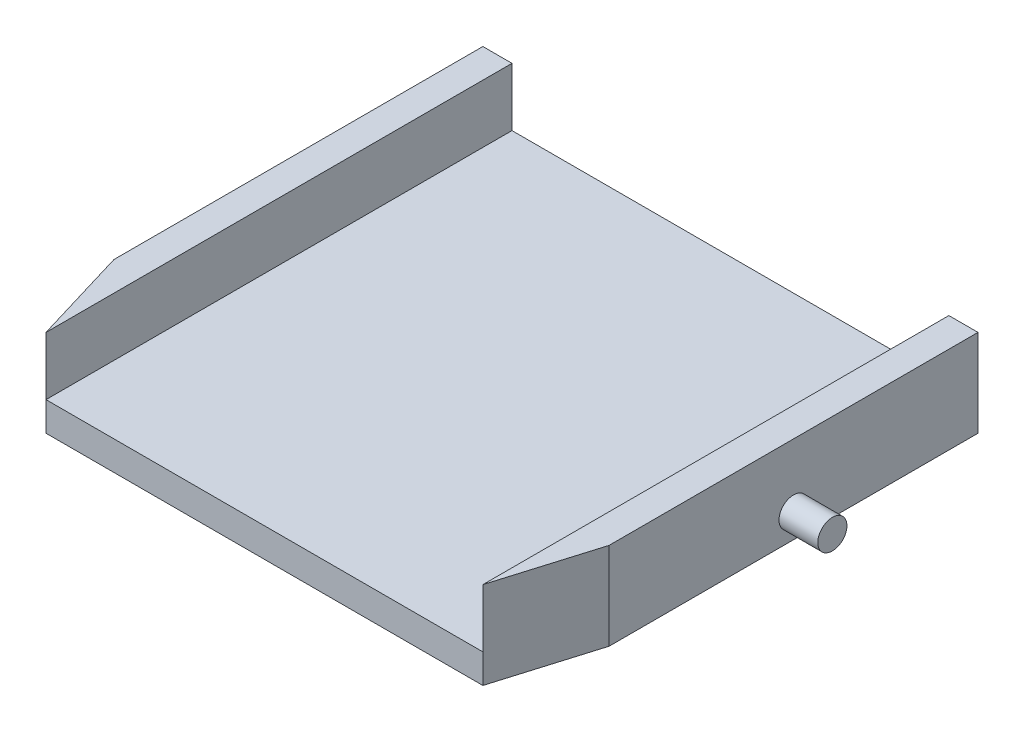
ISO-10303-21;
HEADER;
FILE_DESCRIPTION(('STEP AP214'),'2;1');
FILE_NAME('part.step','',(''),(''),'','','');
FILE_SCHEMA(('AUTOMOTIVE_DESIGN { 1 0 10303 214 1 1 1 1 }'));
ENDSEC;
DATA;
#1=APPLICATION_CONTEXT('core data for automotive mechanical design processes');
#2=APPLICATION_PROTOCOL_DEFINITION('international standard','automotive_design',2000,#1);
#3=PRODUCT_CONTEXT('',#1,'mechanical');
#4=PRODUCT('Part','Part','',(#3));
#5=PRODUCT_RELATED_PRODUCT_CATEGORY('part','',(#4));
#6=PRODUCT_DEFINITION_FORMATION('','',#4);
#7=PRODUCT_DEFINITION_CONTEXT('part definition',#1,'design');
#8=PRODUCT_DEFINITION('design','',#6,#7);
#9=PRODUCT_DEFINITION_SHAPE('','',#8);
#10=(LENGTH_UNIT() NAMED_UNIT(*) SI_UNIT(.MILLI.,.METRE.));
#11=(NAMED_UNIT(*) PLANE_ANGLE_UNIT() SI_UNIT($,.RADIAN.));
#12=(NAMED_UNIT(*) SI_UNIT($,.STERADIAN.) SOLID_ANGLE_UNIT());
#13=UNCERTAINTY_MEASURE_WITH_UNIT(LENGTH_MEASURE(1.E-05),#10,'distance_accuracy_value','');
#14=(GEOMETRIC_REPRESENTATION_CONTEXT(3) GLOBAL_UNCERTAINTY_ASSIGNED_CONTEXT((#13)) GLOBAL_UNIT_ASSIGNED_CONTEXT((#10,
#11,#12)) REPRESENTATION_CONTEXT('',''));
#15=CARTESIAN_POINT('',(0.,0.,0.));
#16=DIRECTION('',(0.,0.,1.));
#17=DIRECTION('',(1.,0.,0.));
#18=AXIS2_PLACEMENT_3D('',#15,#16,#17);
#19=CARTESIAN_POINT('',(0.,3.,0.));
#20=DIRECTION('',(0.,-1.,0.));
#21=DIRECTION('',(0.,0.,-1.));
#22=AXIS2_PLACEMENT_3D('',#19,#20,#21);
#23=PLANE('',#22);
#24=DIRECTION('',(0.,0.,1.));
#25=VECTOR('',#24,1.);
#26=CARTESIAN_POINT('',(45.,3.,-48.));
#27=LINE('',#26,#25);
#28=CARTESIAN_POINT('',(45.,3.,-48.));
#29=VERTEX_POINT('',#28);
#30=CARTESIAN_POINT('',(45.,3.,0.));
#31=VERTEX_POINT('',#30);
#32=EDGE_CURVE('E165',#29,#31,#27,.T.);
#33=ORIENTED_EDGE('',*,*,#32,.F.);
#34=DIRECTION('',(-1.,0.,0.));
#35=VECTOR('',#34,1.);
#36=CARTESIAN_POINT('',(48.,3.,-48.));
#37=LINE('',#36,#35);
#38=CARTESIAN_POINT('',(0.,3.,-48.));
#39=VERTEX_POINT('',#38);
#40=EDGE_CURVE('E96',#29,#39,#37,.T.);
#41=ORIENTED_EDGE('',*,*,#40,.T.);
#42=DIRECTION('',(0.,0.,-1.));
#43=VECTOR('',#42,1.);
#44=CARTESIAN_POINT('',(0.,3.,0.));
#45=LINE('',#44,#43);
#46=CARTESIAN_POINT('',(0.,3.,0.));
#47=VERTEX_POINT('',#46);
#48=EDGE_CURVE('E172',#47,#39,#45,.T.);
#49=ORIENTED_EDGE('',*,*,#48,.F.);
#50=DIRECTION('',(1.,0.,0.));
#51=VECTOR('',#50,1.);
#52=CARTESIAN_POINT('',(0.,3.,0.));
#53=LINE('',#52,#51);
#54=EDGE_CURVE('E50',#47,#31,#53,.T.);
#55=ORIENTED_EDGE('',*,*,#54,.T.);
#56=EDGE_LOOP('',(#33,#41,#49,#55));
#57=FACE_BOUND('',#56,.T.);
#58=ADVANCED_FACE('F33',(#57),#23,.F.);
#59=CARTESIAN_POINT('',(0.,3.,0.));
#60=DIRECTION('',(0.957826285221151,0.,-0.287347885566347));
#61=DIRECTION('',(-0.287347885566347,0.,-0.957826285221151));
#62=AXIS2_PLACEMENT_3D('',#59,#60,#61);
#63=PLANE('',#62);
#64=DIRECTION('',(0.287347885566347,0.,0.957826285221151));
#65=VECTOR('',#64,1.);
#66=CARTESIAN_POINT('',(0.,0.,0.));
#67=LINE('',#66,#65);
#68=CARTESIAN_POINT('',(-3.00000000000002,0.,-10.));
#69=VERTEX_POINT('',#68);
#70=CARTESIAN_POINT('',(0.,0.,0.));
#71=VERTEX_POINT('',#70);
#72=EDGE_CURVE('E92',#69,#71,#67,.T.);
#73=ORIENTED_EDGE('',*,*,#72,.T.);
#74=DIRECTION('',(0.,-1.,0.));
#75=VECTOR('',#74,1.);
#76=CARTESIAN_POINT('',(0.,3.,0.));
#77=LINE('',#76,#75);
#78=EDGE_CURVE('E126',#47,#71,#77,.T.);
#79=ORIENTED_EDGE('',*,*,#78,.F.);
#80=DIRECTION('',(0.,-1.,0.));
#81=VECTOR('',#80,1.);
#82=CARTESIAN_POINT('',(0.,9.,0.));
#83=LINE('',#82,#81);
#84=CARTESIAN_POINT('',(0.,9.,0.));
#85=VERTEX_POINT('',#84);
#86=EDGE_CURVE('E102',#85,#47,#83,.T.);
#87=ORIENTED_EDGE('',*,*,#86,.F.);
#88=DIRECTION('',(0.287347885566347,0.,0.957826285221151));
#89=VECTOR('',#88,1.);
#90=CARTESIAN_POINT('',(-3.00000000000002,9.,-10.));
#91=LINE('',#90,#89);
#92=CARTESIAN_POINT('',(-3.00000000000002,9.,-10.));
#93=VERTEX_POINT('',#92);
#94=EDGE_CURVE('E95',#93,#85,#91,.T.);
#95=ORIENTED_EDGE('',*,*,#94,.F.);
#96=DIRECTION('',(0.,-1.,0.));
#97=VECTOR('',#96,1.);
#98=CARTESIAN_POINT('',(-3.00000000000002,3.,-10.));
#99=LINE('',#98,#97);
#100=EDGE_CURVE('E82',#93,#69,#99,.T.);
#101=ORIENTED_EDGE('',*,*,#100,.T.);
#102=EDGE_LOOP('',(#73,#79,#87,#95,#101));
#103=FACE_BOUND('',#102,.T.);
#104=ADVANCED_FACE('F35',(#103),#63,.F.);
#105=CARTESIAN_POINT('',(0.,3.,0.));
#106=DIRECTION('',(0.,0.,-1.));
#107=DIRECTION('',(-1.,0.,0.));
#108=AXIS2_PLACEMENT_3D('',#105,#106,#107);
#109=PLANE('',#108);
#110=DIRECTION('',(1.,0.,0.));
#111=VECTOR('',#110,1.);
#112=CARTESIAN_POINT('',(0.,0.,0.));
#113=LINE('',#112,#111);
#114=CARTESIAN_POINT('',(45.,0.,0.));
#115=VERTEX_POINT('',#114);
#116=EDGE_CURVE('E100',#71,#115,#113,.T.);
#117=ORIENTED_EDGE('',*,*,#116,.T.);
#118=DIRECTION('',(0.,-1.,0.));
#119=VECTOR('',#118,1.);
#120=CARTESIAN_POINT('',(45.,3.,0.));
#121=LINE('',#120,#119);
#122=EDGE_CURVE('E123',#31,#115,#121,.T.);
#123=ORIENTED_EDGE('',*,*,#122,.F.);
#124=ORIENTED_EDGE('',*,*,#54,.F.);
#125=ORIENTED_EDGE('',*,*,#78,.T.);
#126=EDGE_LOOP('',(#117,#123,#124,#125));
#127=FACE_BOUND('',#126,.T.);
#128=ADVANCED_FACE('F228',(#127),#109,.F.);
#129=CARTESIAN_POINT('',(45.,3.,0.));
#130=DIRECTION('',(-0.957826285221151,0.,-0.287347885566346));
#131=DIRECTION('',(-0.287347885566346,0.,0.957826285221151));
#132=AXIS2_PLACEMENT_3D('',#129,#130,#131);
#133=PLANE('',#132);
#134=DIRECTION('',(0.287347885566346,0.,-0.957826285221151));
#135=VECTOR('',#134,1.);
#136=CARTESIAN_POINT('',(45.,0.,0.));
#137=LINE('',#136,#135);
#138=CARTESIAN_POINT('',(48.,0.,-10.));
#139=VERTEX_POINT('',#138);
#140=EDGE_CURVE('E104',#115,#139,#137,.T.);
#141=ORIENTED_EDGE('',*,*,#140,.T.);
#142=DIRECTION('',(0.,-1.,0.));
#143=VECTOR('',#142,1.);
#144=CARTESIAN_POINT('',(48.,3.,-10.));
#145=LINE('',#144,#143);
#146=CARTESIAN_POINT('',(48.,9.,-10.));
#147=VERTEX_POINT('',#146);
#148=EDGE_CURVE('E120',#147,#139,#145,.T.);
#149=ORIENTED_EDGE('',*,*,#148,.F.);
#150=DIRECTION('',(0.287347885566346,0.,-0.957826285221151));
#151=VECTOR('',#150,1.);
#152=CARTESIAN_POINT('',(45.,9.,0.));
#153=LINE('',#152,#151);
#154=CARTESIAN_POINT('',(45.,9.,0.));
#155=VERTEX_POINT('',#154);
#156=EDGE_CURVE('E161',#155,#147,#153,.T.);
#157=ORIENTED_EDGE('',*,*,#156,.F.);
#158=DIRECTION('',(0.,-1.,0.));
#159=VECTOR('',#158,1.);
#160=CARTESIAN_POINT('',(45.,9.,0.));
#161=LINE('',#160,#159);
#162=EDGE_CURVE('E159',#155,#31,#161,.T.);
#163=ORIENTED_EDGE('',*,*,#162,.T.);
#164=ORIENTED_EDGE('',*,*,#122,.T.);
#165=EDGE_LOOP('',(#141,#149,#157,#163,#164));
#166=FACE_BOUND('',#165,.T.);
#167=ADVANCED_FACE('F136',(#166),#133,.F.);
#168=CARTESIAN_POINT('',(48.,3.,-10.));
#169=DIRECTION('',(-1.,0.,0.));
#170=DIRECTION('',(0.,0.,1.));
#171=AXIS2_PLACEMENT_3D('',#168,#169,#170);
#172=PLANE('',#171);
#173=CARTESIAN_POINT('',(48.,2.5,-29.));
#174=DIRECTION('',(-1.,0.,0.));
#175=DIRECTION('',(0.,0.,1.));
#176=AXIS2_PLACEMENT_3D('',#173,#174,#175);
#177=CIRCLE('',#176,1.5);
#178=CARTESIAN_POINT('',(48.,2.5,-27.5));
#179=VERTEX_POINT('',#178);
#180=EDGE_CURVE('E42',#179,#179,#177,.F.);
#181=ORIENTED_EDGE('',*,*,#180,.F.);
#182=EDGE_LOOP('',(#181));
#183=FACE_BOUND('',#182,.T.);
#184=DIRECTION('',(0.,0.,-1.));
#185=VECTOR('',#184,1.);
#186=CARTESIAN_POINT('',(48.,0.,-10.));
#187=LINE('',#186,#185);
#188=CARTESIAN_POINT('',(48.,0.,-48.));
#189=VERTEX_POINT('',#188);
#190=EDGE_CURVE('E113',#139,#189,#187,.T.);
#191=ORIENTED_EDGE('',*,*,#190,.T.);
#192=DIRECTION('',(0.,-1.,0.));
#193=VECTOR('',#192,1.);
#194=CARTESIAN_POINT('',(48.,3.,-48.));
#195=LINE('',#194,#193);
#196=CARTESIAN_POINT('',(48.,9.,-48.));
#197=VERTEX_POINT('',#196);
#198=EDGE_CURVE('E118',#197,#189,#195,.T.);
#199=ORIENTED_EDGE('',*,*,#198,.F.);
#200=DIRECTION('',(0.,0.,-1.));
#201=VECTOR('',#200,1.);
#202=CARTESIAN_POINT('',(48.,9.,-10.));
#203=LINE('',#202,#201);
#204=EDGE_CURVE('E157',#147,#197,#203,.T.);
#205=ORIENTED_EDGE('',*,*,#204,.F.);
#206=ORIENTED_EDGE('',*,*,#148,.T.);
#207=EDGE_LOOP('',(#191,#199,#205,#206));
#208=FACE_BOUND('',#207,.T.);
#209=ADVANCED_FACE('F132',(#183,#208),#172,.F.);
#210=CARTESIAN_POINT('',(-3.00000000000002,3.,-48.));
#211=DIRECTION('',(0.,0.,1.));
#212=DIRECTION('',(1.,0.,0.));
#213=AXIS2_PLACEMENT_3D('',#210,#211,#212);
#214=PLANE('',#213);
#215=DIRECTION('',(-1.,0.,0.));
#216=VECTOR('',#215,1.);
#217=CARTESIAN_POINT('',(-3.00000000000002,0.,-48.));
#218=LINE('',#217,#216);
#219=CARTESIAN_POINT('',(-3.00000000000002,0.,-48.));
#220=VERTEX_POINT('',#219);
#221=EDGE_CURVE('E72',#189,#220,#218,.T.);
#222=ORIENTED_EDGE('',*,*,#221,.T.);
#223=DIRECTION('',(0.,-1.,0.));
#224=VECTOR('',#223,1.);
#225=CARTESIAN_POINT('',(-3.00000000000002,3.,-48.));
#226=LINE('',#225,#224);
#227=CARTESIAN_POINT('',(-3.00000000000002,9.,-48.));
#228=VERTEX_POINT('',#227);
#229=EDGE_CURVE('E84',#228,#220,#226,.T.);
#230=ORIENTED_EDGE('',*,*,#229,.F.);
#231=DIRECTION('',(-1.,0.,0.));
#232=VECTOR('',#231,1.);
#233=CARTESIAN_POINT('',(0.,9.,-48.));
#234=LINE('',#233,#232);
#235=CARTESIAN_POINT('',(0.,9.,-48.));
#236=VERTEX_POINT('',#235);
#237=EDGE_CURVE('E177',#236,#228,#234,.T.);
#238=ORIENTED_EDGE('',*,*,#237,.F.);
#239=DIRECTION('',(0.,-1.,0.));
#240=VECTOR('',#239,1.);
#241=CARTESIAN_POINT('',(0.,9.,-48.));
#242=LINE('',#241,#240);
#243=EDGE_CURVE('E107',#236,#39,#242,.T.);
#244=ORIENTED_EDGE('',*,*,#243,.T.);
#245=ORIENTED_EDGE('',*,*,#40,.F.);
#246=DIRECTION('',(0.,-1.,0.));
#247=VECTOR('',#246,1.);
#248=CARTESIAN_POINT('',(45.,9.,-48.));
#249=LINE('',#248,#247);
#250=CARTESIAN_POINT('',(45.,9.,-48.));
#251=VERTEX_POINT('',#250);
#252=EDGE_CURVE('E151',#251,#29,#249,.T.);
#253=ORIENTED_EDGE('',*,*,#252,.F.);
#254=DIRECTION('',(-1.,0.,0.));
#255=VECTOR('',#254,1.);
#256=CARTESIAN_POINT('',(48.,9.,-48.));
#257=LINE('',#256,#255);
#258=EDGE_CURVE('E147',#197,#251,#257,.T.);
#259=ORIENTED_EDGE('',*,*,#258,.F.);
#260=ORIENTED_EDGE('',*,*,#198,.T.);
#261=EDGE_LOOP('',(#222,#230,#238,#244,#245,#253,#259,#260));
#262=FACE_BOUND('',#261,.T.);
#263=ADVANCED_FACE('F135',(#262),#214,.F.);
#264=CARTESIAN_POINT('',(-3.00000000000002,3.,-10.));
#265=DIRECTION('',(1.,0.,0.));
#266=DIRECTION('',(0.,0.,-1.));
#267=AXIS2_PLACEMENT_3D('',#264,#265,#266);
#268=PLANE('',#267);
#269=CARTESIAN_POINT('',(-3.00000000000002,2.5,-29.));
#270=DIRECTION('',(1.,0.,0.));
#271=DIRECTION('',(0.,0.,-1.));
#272=AXIS2_PLACEMENT_3D('',#269,#270,#271);
#273=CIRCLE('',#272,1.5);
#274=CARTESIAN_POINT('',(-3.00000000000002,2.5,-30.5));
#275=VERTEX_POINT('',#274);
#276=EDGE_CURVE('E11',#275,#275,#273,.F.);
#277=ORIENTED_EDGE('',*,*,#276,.F.);
#278=EDGE_LOOP('',(#277));
#279=FACE_BOUND('',#278,.T.);
#280=DIRECTION('',(0.,0.,1.));
#281=VECTOR('',#280,1.);
#282=CARTESIAN_POINT('',(-3.00000000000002,0.,-10.));
#283=LINE('',#282,#281);
#284=EDGE_CURVE('E78',#220,#69,#283,.T.);
#285=ORIENTED_EDGE('',*,*,#284,.T.);
#286=ORIENTED_EDGE('',*,*,#100,.F.);
#287=DIRECTION('',(0.,0.,1.));
#288=VECTOR('',#287,1.);
#289=CARTESIAN_POINT('',(-3.00000000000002,9.,-48.));
#290=LINE('',#289,#288);
#291=EDGE_CURVE('E180',#228,#93,#290,.T.);
#292=ORIENTED_EDGE('',*,*,#291,.F.);
#293=ORIENTED_EDGE('',*,*,#229,.T.);
#294=EDGE_LOOP('',(#285,#286,#292,#293));
#295=FACE_BOUND('',#294,.T.);
#296=ADVANCED_FACE('F80',(#279,#295),#268,.F.);
#297=CARTESIAN_POINT('',(0.,0.,0.));
#298=DIRECTION('',(0.,-1.,0.));
#299=DIRECTION('',(0.,0.,-1.));
#300=AXIS2_PLACEMENT_3D('',#297,#298,#299);
#301=PLANE('',#300);
#302=ORIENTED_EDGE('',*,*,#72,.F.);
#303=ORIENTED_EDGE('',*,*,#284,.F.);
#304=ORIENTED_EDGE('',*,*,#221,.F.);
#305=ORIENTED_EDGE('',*,*,#190,.F.);
#306=ORIENTED_EDGE('',*,*,#140,.F.);
#307=ORIENTED_EDGE('',*,*,#116,.F.);
#308=EDGE_LOOP('',(#302,#303,#304,#305,#306,#307));
#309=FACE_BOUND('',#308,.T.);
#310=ADVANCED_FACE('F98',(#309),#301,.T.);
#311=CARTESIAN_POINT('',(0.,9.,0.));
#312=DIRECTION('',(-1.,0.,0.));
#313=DIRECTION('',(0.,0.,1.));
#314=AXIS2_PLACEMENT_3D('',#311,#312,#313);
#315=PLANE('',#314);
#316=ORIENTED_EDGE('',*,*,#48,.T.);
#317=ORIENTED_EDGE('',*,*,#243,.F.);
#318=DIRECTION('',(0.,0.,-1.));
#319=VECTOR('',#318,1.);
#320=CARTESIAN_POINT('',(0.,9.,0.));
#321=LINE('',#320,#319);
#322=EDGE_CURVE('E174',#85,#236,#321,.T.);
#323=ORIENTED_EDGE('',*,*,#322,.F.);
#324=ORIENTED_EDGE('',*,*,#86,.T.);
#325=EDGE_LOOP('',(#316,#317,#323,#324));
#326=FACE_BOUND('',#325,.T.);
#327=ADVANCED_FACE('F191',(#326),#315,.F.);
#328=CARTESIAN_POINT('',(0.,9.,0.));
#329=DIRECTION('',(0.,-1.,0.));
#330=DIRECTION('',(0.,0.,-1.));
#331=AXIS2_PLACEMENT_3D('',#328,#329,#330);
#332=PLANE('',#331);
#333=ORIENTED_EDGE('',*,*,#94,.T.);
#334=ORIENTED_EDGE('',*,*,#322,.T.);
#335=ORIENTED_EDGE('',*,*,#237,.T.);
#336=ORIENTED_EDGE('',*,*,#291,.T.);
#337=EDGE_LOOP('',(#333,#334,#335,#336));
#338=FACE_BOUND('',#337,.T.);
#339=ADVANCED_FACE('F198',(#338),#332,.F.);
#340=CARTESIAN_POINT('',(45.,9.,-48.));
#341=DIRECTION('',(1.,0.,0.));
#342=DIRECTION('',(0.,0.,-1.));
#343=AXIS2_PLACEMENT_3D('',#340,#341,#342);
#344=PLANE('',#343);
#345=ORIENTED_EDGE('',*,*,#32,.T.);
#346=ORIENTED_EDGE('',*,*,#162,.F.);
#347=DIRECTION('',(0.,0.,1.));
#348=VECTOR('',#347,1.);
#349=CARTESIAN_POINT('',(45.,9.,-48.));
#350=LINE('',#349,#348);
#351=EDGE_CURVE('E167',#251,#155,#350,.T.);
#352=ORIENTED_EDGE('',*,*,#351,.F.);
#353=ORIENTED_EDGE('',*,*,#252,.T.);
#354=EDGE_LOOP('',(#345,#346,#352,#353));
#355=FACE_BOUND('',#354,.T.);
#356=ADVANCED_FACE('F214',(#355),#344,.F.);
#357=CARTESIAN_POINT('',(0.,9.,0.));
#358=DIRECTION('',(0.,-1.,0.));
#359=DIRECTION('',(0.,0.,-1.));
#360=AXIS2_PLACEMENT_3D('',#357,#358,#359);
#361=PLANE('',#360);
#362=ORIENTED_EDGE('',*,*,#351,.T.);
#363=ORIENTED_EDGE('',*,*,#156,.T.);
#364=ORIENTED_EDGE('',*,*,#204,.T.);
#365=ORIENTED_EDGE('',*,*,#258,.T.);
#366=EDGE_LOOP('',(#362,#363,#364,#365));
#367=FACE_BOUND('',#366,.T.);
#368=ADVANCED_FACE('F211',(#367),#361,.F.);
#369=CARTESIAN_POINT('',(52.,2.5,-29.));
#370=DIRECTION('',(-1.,0.,0.));
#371=DIRECTION('',(0.,0.,1.));
#372=AXIS2_PLACEMENT_3D('',#369,#370,#371);
#373=CYLINDRICAL_SURFACE('',#372,1.5);
#374=CARTESIAN_POINT('',(52.,2.5,-29.));
#375=DIRECTION('',(1.,0.,0.));
#376=DIRECTION('',(0.,0.,-1.));
#377=AXIS2_PLACEMENT_3D('',#374,#375,#376);
#378=CIRCLE('',#377,1.5);
#379=CARTESIAN_POINT('',(52.,2.5,-30.5));
#380=VERTEX_POINT('',#379);
#381=EDGE_CURVE('E168',#380,#380,#378,.T.);
#382=ORIENTED_EDGE('',*,*,#381,.F.);
#383=EDGE_LOOP('',(#382));
#384=FACE_BOUND('',#383,.T.);
#385=ORIENTED_EDGE('',*,*,#180,.T.);
#386=EDGE_LOOP('',(#385));
#387=FACE_BOUND('',#386,.T.);
#388=ADVANCED_FACE('F130',(#384,#387),#373,.T.);
#389=CARTESIAN_POINT('',(52.,2.5,-29.));
#390=DIRECTION('',(1.,0.,0.));
#391=DIRECTION('',(0.,0.,-1.));
#392=AXIS2_PLACEMENT_3D('',#389,#390,#391);
#393=PLANE('',#392);
#394=ORIENTED_EDGE('',*,*,#381,.T.);
#395=EDGE_LOOP('',(#394));
#396=FACE_BOUND('',#395,.T.);
#397=ADVANCED_FACE('F302',(#396),#393,.T.);
#398=CARTESIAN_POINT('',(-7.00000000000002,2.5,-29.));
#399=DIRECTION('',(1.,0.,0.));
#400=DIRECTION('',(0.,0.,-1.));
#401=AXIS2_PLACEMENT_3D('',#398,#399,#400);
#402=CYLINDRICAL_SURFACE('',#401,1.5);
#403=CARTESIAN_POINT('',(-7.00000000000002,2.5,-29.));
#404=DIRECTION('',(-1.,0.,0.));
#405=DIRECTION('',(0.,0.,1.));
#406=AXIS2_PLACEMENT_3D('',#403,#404,#405);
#407=CIRCLE('',#406,1.5);
#408=CARTESIAN_POINT('',(-7.00000000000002,2.5,-27.5));
#409=VERTEX_POINT('',#408);
#410=EDGE_CURVE('E336',#409,#409,#407,.T.);
#411=ORIENTED_EDGE('',*,*,#410,.F.);
#412=EDGE_LOOP('',(#411));
#413=FACE_BOUND('',#412,.T.);
#414=ORIENTED_EDGE('',*,*,#276,.T.);
#415=EDGE_LOOP('',(#414));
#416=FACE_BOUND('',#415,.T.);
#417=ADVANCED_FACE('F308',(#413,#416),#402,.T.);
#418=CARTESIAN_POINT('',(-7.00000000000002,2.5,-29.));
#419=DIRECTION('',(-1.,0.,0.));
#420=DIRECTION('',(0.,0.,1.));
#421=AXIS2_PLACEMENT_3D('',#418,#419,#420);
#422=PLANE('',#421);
#423=ORIENTED_EDGE('',*,*,#410,.T.);
#424=EDGE_LOOP('',(#423));
#425=FACE_BOUND('',#424,.T.);
#426=ADVANCED_FACE('F315',(#425),#422,.T.);
#427=CLOSED_SHELL('',(#58,#104,#128,#167,#209,#263,#296,#310,#327,#339,#356,#368,#388,#397,#417,#426));
#428=MANIFOLD_SOLID_BREP('B2',#427);
#429=ADVANCED_BREP_SHAPE_REPRESENTATION('',(#18,#428),#14);
#430=SHAPE_DEFINITION_REPRESENTATION(#9,#429);
ENDSEC;
END-ISO-10303-21;
